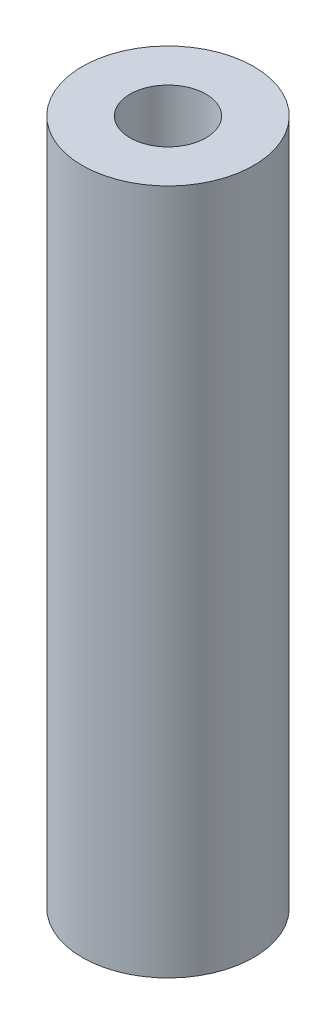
ISO-10303-21;
HEADER;
FILE_DESCRIPTION(('STEP AP214'),'2;1');
FILE_NAME('part.step','',(''),(''),'','','');
FILE_SCHEMA(('AUTOMOTIVE_DESIGN { 1 0 10303 214 1 1 1 1 }'));
ENDSEC;
DATA;
#1=APPLICATION_CONTEXT('core data for automotive mechanical design processes');
#2=APPLICATION_PROTOCOL_DEFINITION('international standard','automotive_design',2000,#1);
#3=PRODUCT_CONTEXT('',#1,'mechanical');
#4=PRODUCT('Part','Part','',(#3));
#5=PRODUCT_RELATED_PRODUCT_CATEGORY('part','',(#4));
#6=PRODUCT_DEFINITION_FORMATION('','',#4);
#7=PRODUCT_DEFINITION_CONTEXT('part definition',#1,'design');
#8=PRODUCT_DEFINITION('design','',#6,#7);
#9=PRODUCT_DEFINITION_SHAPE('','',#8);
#10=(LENGTH_UNIT() NAMED_UNIT(*) SI_UNIT(.MILLI.,.METRE.));
#11=(NAMED_UNIT(*) PLANE_ANGLE_UNIT() SI_UNIT($,.RADIAN.));
#12=(NAMED_UNIT(*) SI_UNIT($,.STERADIAN.) SOLID_ANGLE_UNIT());
#13=UNCERTAINTY_MEASURE_WITH_UNIT(LENGTH_MEASURE(1.E-05),#10,'distance_accuracy_value','');
#14=(GEOMETRIC_REPRESENTATION_CONTEXT(3) GLOBAL_UNCERTAINTY_ASSIGNED_CONTEXT((#13)) GLOBAL_UNIT_ASSIGNED_CONTEXT((#10,
#11,#12)) REPRESENTATION_CONTEXT('',''));
#15=CARTESIAN_POINT('',(0.,0.,0.));
#16=DIRECTION('',(0.,0.,1.));
#17=DIRECTION('',(1.,0.,0.));
#18=AXIS2_PLACEMENT_3D('',#15,#16,#17);
#19=CARTESIAN_POINT('',(0.,38.1,0.));
#20=DIRECTION('',(0.,1.,0.));
#21=DIRECTION('',(0.,0.,1.));
#22=AXIS2_PLACEMENT_3D('',#19,#20,#21);
#23=PLANE('',#22);
#24=CARTESIAN_POINT('',(0.,38.1,0.));
#25=DIRECTION('',(0.,1.,0.));
#26=DIRECTION('',(0.,0.,1.));
#27=AXIS2_PLACEMENT_3D('',#24,#25,#26);
#28=CIRCLE('',#27,4.7625);
#29=CARTESIAN_POINT('',(0.,38.1,-4.7625));
#30=VERTEX_POINT('',#29);
#31=EDGE_CURVE('E10',#30,#30,#28,.T.);
#32=ORIENTED_EDGE('',*,*,#31,.T.);
#33=EDGE_LOOP('',(#32));
#34=FACE_BOUND('',#33,.T.);
#35=CARTESIAN_POINT('',(0.,38.1,0.));
#36=DIRECTION('',(0.,1.,0.));
#37=DIRECTION('',(0.,0.,1.));
#38=AXIS2_PLACEMENT_3D('',#35,#36,#37);
#39=CIRCLE('',#38,2.1082);
#40=CARTESIAN_POINT('',(0.,38.1,-2.1082));
#41=VERTEX_POINT('',#40);
#42=EDGE_CURVE('E389',#41,#41,#39,.T.);
#43=ORIENTED_EDGE('',*,*,#42,.F.);
#44=EDGE_LOOP('',(#43));
#45=FACE_BOUND('',#44,.T.);
#46=ADVANCED_FACE('F378',(#34,#45),#23,.T.);
#47=CARTESIAN_POINT('',(0.,0.,0.));
#48=DIRECTION('',(0.,1.,0.));
#49=DIRECTION('',(0.,0.,1.));
#50=AXIS2_PLACEMENT_3D('',#47,#48,#49);
#51=PLANE('',#50);
#52=CARTESIAN_POINT('',(0.,0.,0.));
#53=DIRECTION('',(0.,1.,0.));
#54=DIRECTION('',(0.,0.,1.));
#55=AXIS2_PLACEMENT_3D('',#52,#53,#54);
#56=CIRCLE('',#55,4.7625);
#57=CARTESIAN_POINT('',(0.,0.,-4.7625));
#58=VERTEX_POINT('',#57);
#59=EDGE_CURVE('E385',#58,#58,#56,.T.);
#60=ORIENTED_EDGE('',*,*,#59,.F.);
#61=EDGE_LOOP('',(#60));
#62=FACE_BOUND('',#61,.T.);
#63=CARTESIAN_POINT('',(0.,0.,0.));
#64=DIRECTION('',(0.,1.,0.));
#65=DIRECTION('',(0.,0.,1.));
#66=AXIS2_PLACEMENT_3D('',#63,#64,#65);
#67=CIRCLE('',#66,2.1082);
#68=CARTESIAN_POINT('',(0.,0.,-2.1082));
#69=VERTEX_POINT('',#68);
#70=EDGE_CURVE('E393',#69,#69,#67,.T.);
#71=ORIENTED_EDGE('',*,*,#70,.T.);
#72=EDGE_LOOP('',(#71));
#73=FACE_BOUND('',#72,.T.);
#74=ADVANCED_FACE('F399',(#62,#73),#51,.F.);
#75=CARTESIAN_POINT('',(0.,38.1,0.));
#76=DIRECTION('',(0.,-1.,0.));
#77=DIRECTION('',(0.,0.,-1.));
#78=AXIS2_PLACEMENT_3D('',#75,#76,#77);
#79=CYLINDRICAL_SURFACE('',#78,4.7625);
#80=CARTESIAN_POINT('',(0.,38.1,-4.7625));
#81=CARTESIAN_POINT('',(0.,37.703125,-4.7625));
#82=CARTESIAN_POINT('',(0.,37.30625,-4.7625));
#83=CARTESIAN_POINT('',(0.,36.5125,-4.7625));
#84=CARTESIAN_POINT('',(0.,36.115625,-4.7625));
#85=CARTESIAN_POINT('',(0.,35.321875,-4.7625));
#86=CARTESIAN_POINT('',(0.,34.925,-4.7625));
#87=CARTESIAN_POINT('',(0.,34.13125,-4.7625));
#88=CARTESIAN_POINT('',(0.,33.734375,-4.7625));
#89=CARTESIAN_POINT('',(0.,32.940625,-4.7625));
#90=CARTESIAN_POINT('',(0.,32.54375,-4.7625));
#91=CARTESIAN_POINT('',(0.,31.75,-4.7625));
#92=CARTESIAN_POINT('',(0.,31.353125,-4.7625));
#93=CARTESIAN_POINT('',(0.,30.559375,-4.7625));
#94=CARTESIAN_POINT('',(0.,30.1625,-4.7625));
#95=CARTESIAN_POINT('',(0.,29.36875,-4.7625));
#96=CARTESIAN_POINT('',(0.,28.971875,-4.7625));
#97=CARTESIAN_POINT('',(0.,28.178125,-4.7625));
#98=CARTESIAN_POINT('',(0.,27.78125,-4.7625));
#99=CARTESIAN_POINT('',(0.,26.9875,-4.7625));
#100=CARTESIAN_POINT('',(0.,26.590625,-4.7625));
#101=CARTESIAN_POINT('',(0.,25.796875,-4.7625));
#102=CARTESIAN_POINT('',(0.,25.4,-4.7625));
#103=CARTESIAN_POINT('',(0.,24.60625,-4.7625));
#104=CARTESIAN_POINT('',(0.,24.209375,-4.7625));
#105=CARTESIAN_POINT('',(0.,23.415625,-4.7625));
#106=CARTESIAN_POINT('',(0.,23.01875,-4.7625));
#107=CARTESIAN_POINT('',(0.,22.225,-4.7625));
#108=CARTESIAN_POINT('',(0.,21.828125,-4.7625));
#109=CARTESIAN_POINT('',(0.,21.034375,-4.7625));
#110=CARTESIAN_POINT('',(0.,20.6375,-4.7625));
#111=CARTESIAN_POINT('',(0.,19.84375,-4.7625));
#112=CARTESIAN_POINT('',(0.,19.446875,-4.7625));
#113=CARTESIAN_POINT('',(0.,18.653125,-4.7625));
#114=CARTESIAN_POINT('',(0.,18.25625,-4.7625));
#115=CARTESIAN_POINT('',(0.,17.4625,-4.7625));
#116=CARTESIAN_POINT('',(0.,17.065625,-4.7625));
#117=CARTESIAN_POINT('',(0.,16.271875,-4.7625));
#118=CARTESIAN_POINT('',(0.,15.875,-4.7625));
#119=CARTESIAN_POINT('',(0.,15.08125,-4.7625));
#120=CARTESIAN_POINT('',(0.,14.684375,-4.7625));
#121=CARTESIAN_POINT('',(0.,13.890625,-4.7625));
#122=CARTESIAN_POINT('',(0.,13.49375,-4.7625));
#123=CARTESIAN_POINT('',(0.,12.7,-4.7625));
#124=CARTESIAN_POINT('',(0.,12.303125,-4.7625));
#125=CARTESIAN_POINT('',(0.,11.509375,-4.7625));
#126=CARTESIAN_POINT('',(0.,11.1125,-4.7625));
#127=CARTESIAN_POINT('',(0.,10.31875,-4.7625));
#128=CARTESIAN_POINT('',(0.,9.92187499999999,-4.7625));
#129=CARTESIAN_POINT('',(0.,9.128125,-4.7625));
#130=CARTESIAN_POINT('',(0.,8.73124999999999,-4.7625));
#131=CARTESIAN_POINT('',(0.,7.93749999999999,-4.7625));
#132=CARTESIAN_POINT('',(0.,7.54062499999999,-4.7625));
#133=CARTESIAN_POINT('',(0.,6.746875,-4.7625));
#134=CARTESIAN_POINT('',(0.,6.35,-4.7625));
#135=CARTESIAN_POINT('',(0.,5.55625,-4.7625));
#136=CARTESIAN_POINT('',(0.,5.159375,-4.7625));
#137=CARTESIAN_POINT('',(0.,4.365625,-4.7625));
#138=CARTESIAN_POINT('',(0.,3.96875,-4.7625));
#139=CARTESIAN_POINT('',(0.,3.175,-4.7625));
#140=CARTESIAN_POINT('',(0.,2.778125,-4.7625));
#141=CARTESIAN_POINT('',(0.,1.984375,-4.7625));
#142=CARTESIAN_POINT('',(0.,1.5875,-4.7625));
#143=CARTESIAN_POINT('',(0.,0.79375,-4.7625));
#144=CARTESIAN_POINT('',(0.,0.396875,-4.7625));
#145=CARTESIAN_POINT('',(0.,0.,-4.7625));
#146=B_SPLINE_CURVE_WITH_KNOTS('',3,(#80,#81,#82,#83,#84,#85,#86,#87,#88,#89,#90,#91,#92,#93,
#94,#95,#96,#97,#98,#99,#100,#101,#102,#103,#104,#105,#106,#107,#108,#109,#110,#111,#112,#113,
#114,#115,#116,#117,#118,#119,#120,#121,#122,#123,#124,#125,#126,#127,#128,#129,#130,#131,#132,
#133,#134,#135,#136,#137,#138,#139,#140,#141,#142,#143,#144,#145),.UNSPECIFIED.,.F.,.F.,(4,2,2,
2,2,2,2,2,2,2,2,2,2,2,2,2,2,2,2,2,2,2,2,2,2,2,2,2,2,2,2,2,4),(0.,1.190625,2.38125,3.571875,
4.7625,5.953125,7.14375,8.334375,9.52500000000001,10.715625,11.90625,13.096875,14.2875,
15.478125,16.66875,17.859375,19.05,20.240625,21.43125,22.621875,23.8125,25.003125,26.19375,
27.384375,28.575,29.765625,30.95625,32.146875,33.3375,34.528125,35.71875,36.909375,38.1),.UNSPECIFIED.);
#147=EDGE_CURVE('BSEAM380',#30,#58,#146,.T.);
#148=ORIENTED_EDGE('',*,*,#31,.F.);
#149=ORIENTED_EDGE('',*,*,#59,.T.);
#150=ORIENTED_EDGE('',*,*,#147,.T.);
#151=ORIENTED_EDGE('',*,*,#147,.F.);
#152=EDGE_LOOP('',(#148,#150,#149,#151));
#153=FACE_BOUND('',#152,.T.);
#154=ADVANCED_FACE('F380',(#153),#79,.T.);
#155=CARTESIAN_POINT('',(0.,38.1,0.));
#156=DIRECTION('',(0.,-1.,0.));
#157=DIRECTION('',(0.,0.,-1.));
#158=AXIS2_PLACEMENT_3D('',#155,#156,#157);
#159=CYLINDRICAL_SURFACE('',#158,2.1082);
#160=CARTESIAN_POINT('',(0.,38.1,-2.1082));
#161=CARTESIAN_POINT('',(0.,37.703125,-2.1082));
#162=CARTESIAN_POINT('',(0.,37.30625,-2.1082));
#163=CARTESIAN_POINT('',(0.,36.5125,-2.1082));
#164=CARTESIAN_POINT('',(0.,36.115625,-2.1082));
#165=CARTESIAN_POINT('',(0.,35.321875,-2.1082));
#166=CARTESIAN_POINT('',(0.,34.925,-2.1082));
#167=CARTESIAN_POINT('',(0.,34.13125,-2.1082));
#168=CARTESIAN_POINT('',(0.,33.734375,-2.1082));
#169=CARTESIAN_POINT('',(0.,32.940625,-2.1082));
#170=CARTESIAN_POINT('',(0.,32.54375,-2.1082));
#171=CARTESIAN_POINT('',(0.,31.75,-2.1082));
#172=CARTESIAN_POINT('',(0.,31.353125,-2.1082));
#173=CARTESIAN_POINT('',(0.,30.559375,-2.1082));
#174=CARTESIAN_POINT('',(0.,30.1625,-2.1082));
#175=CARTESIAN_POINT('',(0.,29.36875,-2.1082));
#176=CARTESIAN_POINT('',(0.,28.971875,-2.1082));
#177=CARTESIAN_POINT('',(0.,28.178125,-2.1082));
#178=CARTESIAN_POINT('',(0.,27.78125,-2.1082));
#179=CARTESIAN_POINT('',(0.,26.9875,-2.1082));
#180=CARTESIAN_POINT('',(0.,26.590625,-2.1082));
#181=CARTESIAN_POINT('',(0.,25.796875,-2.1082));
#182=CARTESIAN_POINT('',(0.,25.4,-2.1082));
#183=CARTESIAN_POINT('',(0.,24.60625,-2.1082));
#184=CARTESIAN_POINT('',(0.,24.209375,-2.1082));
#185=CARTESIAN_POINT('',(0.,23.415625,-2.1082));
#186=CARTESIAN_POINT('',(0.,23.01875,-2.1082));
#187=CARTESIAN_POINT('',(0.,22.225,-2.1082));
#188=CARTESIAN_POINT('',(0.,21.828125,-2.1082));
#189=CARTESIAN_POINT('',(0.,21.034375,-2.1082));
#190=CARTESIAN_POINT('',(0.,20.6375,-2.1082));
#191=CARTESIAN_POINT('',(0.,19.84375,-2.1082));
#192=CARTESIAN_POINT('',(0.,19.446875,-2.1082));
#193=CARTESIAN_POINT('',(0.,18.653125,-2.1082));
#194=CARTESIAN_POINT('',(0.,18.25625,-2.1082));
#195=CARTESIAN_POINT('',(0.,17.4625,-2.1082));
#196=CARTESIAN_POINT('',(0.,17.065625,-2.1082));
#197=CARTESIAN_POINT('',(0.,16.271875,-2.1082));
#198=CARTESIAN_POINT('',(0.,15.875,-2.1082));
#199=CARTESIAN_POINT('',(0.,15.08125,-2.1082));
#200=CARTESIAN_POINT('',(0.,14.684375,-2.1082));
#201=CARTESIAN_POINT('',(0.,13.890625,-2.1082));
#202=CARTESIAN_POINT('',(0.,13.49375,-2.1082));
#203=CARTESIAN_POINT('',(0.,12.7,-2.1082));
#204=CARTESIAN_POINT('',(0.,12.303125,-2.1082));
#205=CARTESIAN_POINT('',(0.,11.509375,-2.1082));
#206=CARTESIAN_POINT('',(0.,11.1125,-2.1082));
#207=CARTESIAN_POINT('',(0.,10.31875,-2.1082));
#208=CARTESIAN_POINT('',(0.,9.92187499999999,-2.1082));
#209=CARTESIAN_POINT('',(0.,9.128125,-2.1082));
#210=CARTESIAN_POINT('',(0.,8.73124999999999,-2.1082));
#211=CARTESIAN_POINT('',(0.,7.93749999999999,-2.1082));
#212=CARTESIAN_POINT('',(0.,7.54062499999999,-2.1082));
#213=CARTESIAN_POINT('',(0.,6.746875,-2.1082));
#214=CARTESIAN_POINT('',(0.,6.35,-2.1082));
#215=CARTESIAN_POINT('',(0.,5.55625,-2.1082));
#216=CARTESIAN_POINT('',(0.,5.159375,-2.1082));
#217=CARTESIAN_POINT('',(0.,4.365625,-2.1082));
#218=CARTESIAN_POINT('',(0.,3.96875,-2.1082));
#219=CARTESIAN_POINT('',(0.,3.175,-2.1082));
#220=CARTESIAN_POINT('',(0.,2.778125,-2.1082));
#221=CARTESIAN_POINT('',(0.,1.984375,-2.1082));
#222=CARTESIAN_POINT('',(0.,1.5875,-2.1082));
#223=CARTESIAN_POINT('',(0.,0.79375,-2.1082));
#224=CARTESIAN_POINT('',(0.,0.396875,-2.1082));
#225=CARTESIAN_POINT('',(0.,0.,-2.1082));
#226=B_SPLINE_CURVE_WITH_KNOTS('',3,(#160,#161,#162,#163,#164,#165,#166,#167,#168,#169,#170,
#171,#172,#173,#174,#175,#176,#177,#178,#179,#180,#181,#182,#183,#184,#185,#186,#187,#188,#189,
#190,#191,#192,#193,#194,#195,#196,#197,#198,#199,#200,#201,#202,#203,#204,#205,#206,#207,#208,
#209,#210,#211,#212,#213,#214,#215,#216,#217,#218,#219,#220,#221,#222,#223,#224,#225),
.UNSPECIFIED.,.F.,.F.,(4,2,2,2,2,2,2,2,2,2,2,2,2,2,2,2,2,2,2,2,2,2,2,2,2,2,2,2,2,2,2,2,4),(0.,
1.190625,2.38125,3.571875,4.7625,5.953125,7.14375,8.334375,9.52500000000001,10.715625,11.90625,
13.096875,14.2875,15.478125,16.66875,17.859375,19.05,20.240625,21.43125,22.621875,23.8125,
25.003125,26.19375,27.384375,28.575,29.765625,30.95625,32.146875,33.3375,34.528125,35.71875,
36.909375,38.1),.UNSPECIFIED.);
#227=EDGE_CURVE('BSEAM401',#41,#69,#226,.T.);
#228=ORIENTED_EDGE('',*,*,#42,.T.);
#229=ORIENTED_EDGE('',*,*,#70,.F.);
#230=ORIENTED_EDGE('',*,*,#227,.T.);
#231=ORIENTED_EDGE('',*,*,#227,.F.);
#232=EDGE_LOOP('',(#228,#230,#229,#231));
#233=FACE_BOUND('',#232,.T.);
#234=ADVANCED_FACE('F401',(#233),#159,.F.);
#235=CLOSED_SHELL('',(#46,#74,#154,#234));
#236=MANIFOLD_SOLID_BREP('B2',#235);
#237=ADVANCED_BREP_SHAPE_REPRESENTATION('',(#18,#236),#14);
#238=SHAPE_DEFINITION_REPRESENTATION(#9,#237);
ENDSEC;
END-ISO-10303-21;
